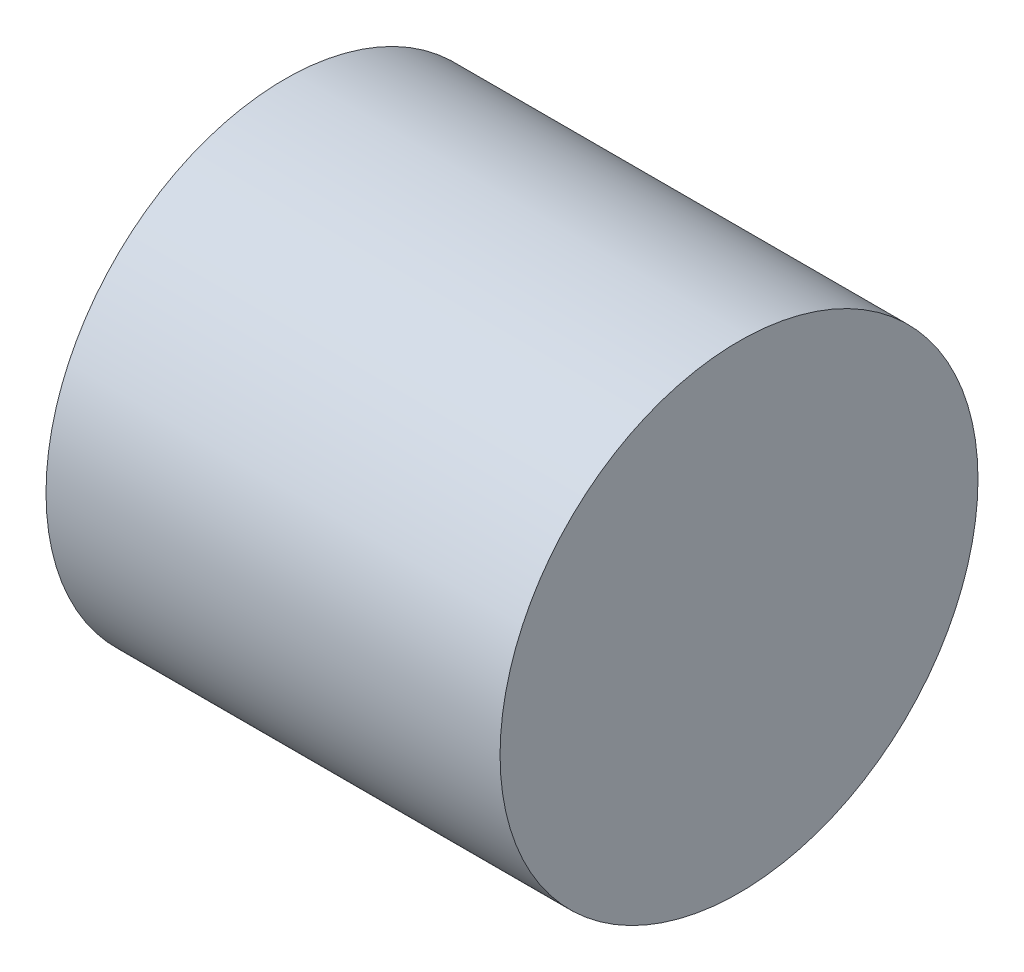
ISO-10303-21;
HEADER;
FILE_DESCRIPTION(('STEP AP214'),'2;1');
FILE_NAME('part.step','',(''),(''),'','','');
FILE_SCHEMA(('AUTOMOTIVE_DESIGN { 1 0 10303 214 1 1 1 1 }'));
ENDSEC;
DATA;
#1=APPLICATION_CONTEXT('core data for automotive mechanical design processes');
#2=APPLICATION_PROTOCOL_DEFINITION('international standard','automotive_design',2000,#1);
#3=PRODUCT_CONTEXT('',#1,'mechanical');
#4=PRODUCT('Part','Part','',(#3));
#5=PRODUCT_RELATED_PRODUCT_CATEGORY('part','',(#4));
#6=PRODUCT_DEFINITION_FORMATION('','',#4);
#7=PRODUCT_DEFINITION_CONTEXT('part definition',#1,'design');
#8=PRODUCT_DEFINITION('design','',#6,#7);
#9=PRODUCT_DEFINITION_SHAPE('','',#8);
#10=(LENGTH_UNIT() NAMED_UNIT(*) SI_UNIT(.MILLI.,.METRE.));
#11=(NAMED_UNIT(*) PLANE_ANGLE_UNIT() SI_UNIT($,.RADIAN.));
#12=(NAMED_UNIT(*) SI_UNIT($,.STERADIAN.) SOLID_ANGLE_UNIT());
#13=UNCERTAINTY_MEASURE_WITH_UNIT(LENGTH_MEASURE(1.E-05),#10,'distance_accuracy_value','');
#14=(GEOMETRIC_REPRESENTATION_CONTEXT(3) GLOBAL_UNCERTAINTY_ASSIGNED_CONTEXT((#13)) GLOBAL_UNIT_ASSIGNED_CONTEXT((#10,
#11,#12)) REPRESENTATION_CONTEXT('',''));
#15=CARTESIAN_POINT('',(0.,0.,0.));
#16=DIRECTION('',(0.,0.,1.));
#17=DIRECTION('',(1.,0.,0.));
#18=AXIS2_PLACEMENT_3D('',#15,#16,#17);
#19=CARTESIAN_POINT('',(47.5,0.,0.));
#20=DIRECTION('',(-1.,0.,0.));
#21=DIRECTION('',(0.,0.,1.));
#22=AXIS2_PLACEMENT_3D('',#19,#20,#21);
#23=CYLINDRICAL_SURFACE('',#22,50.);
#24=CARTESIAN_POINT('',(47.5,0.,0.));
#25=DIRECTION('',(1.,0.,0.));
#26=DIRECTION('',(0.,0.,-1.));
#27=AXIS2_PLACEMENT_3D('',#24,#25,#26);
#28=CIRCLE('',#27,50.);
#29=CARTESIAN_POINT('',(47.5,0.,-50.));
#30=VERTEX_POINT('',#29);
#31=EDGE_CURVE('E10',#30,#30,#28,.T.);
#32=ORIENTED_EDGE('',*,*,#31,.F.);
#33=EDGE_LOOP('',(#32));
#34=FACE_BOUND('',#33,.T.);
#35=CARTESIAN_POINT('',(-47.5,0.,0.));
#36=DIRECTION('',(1.,0.,0.));
#37=DIRECTION('',(0.,0.,-1.));
#38=AXIS2_PLACEMENT_3D('',#35,#36,#37);
#39=CIRCLE('',#38,50.);
#40=CARTESIAN_POINT('',(-47.5,0.,-50.));
#41=VERTEX_POINT('',#40);
#42=EDGE_CURVE('E36',#41,#41,#39,.T.);
#43=ORIENTED_EDGE('',*,*,#42,.T.);
#44=EDGE_LOOP('',(#43));
#45=FACE_BOUND('',#44,.T.);
#46=ADVANCED_FACE('F30',(#34,#45),#23,.T.);
#47=CARTESIAN_POINT('',(47.5,0.,0.));
#48=DIRECTION('',(1.,0.,0.));
#49=DIRECTION('',(0.,0.,-1.));
#50=AXIS2_PLACEMENT_3D('',#47,#48,#49);
#51=PLANE('',#50);
#52=ORIENTED_EDGE('',*,*,#31,.T.);
#53=EDGE_LOOP('',(#52));
#54=FACE_BOUND('',#53,.T.);
#55=ADVANCED_FACE('F45',(#54),#51,.T.);
#56=CARTESIAN_POINT('',(-47.5,0.,0.));
#57=DIRECTION('',(1.,0.,0.));
#58=DIRECTION('',(0.,0.,-1.));
#59=AXIS2_PLACEMENT_3D('',#56,#57,#58);
#60=PLANE('',#59);
#61=ORIENTED_EDGE('',*,*,#42,.F.);
#62=EDGE_LOOP('',(#61));
#63=FACE_BOUND('',#62,.T.);
#64=ADVANCED_FACE('F43',(#63),#60,.F.);
#65=CLOSED_SHELL('',(#46,#55,#64));
#66=MANIFOLD_SOLID_BREP('B2',#65);
#67=ADVANCED_BREP_SHAPE_REPRESENTATION('',(#18,#66),#14);
#68=SHAPE_DEFINITION_REPRESENTATION(#9,#67);
ENDSEC;
END-ISO-10303-21;
